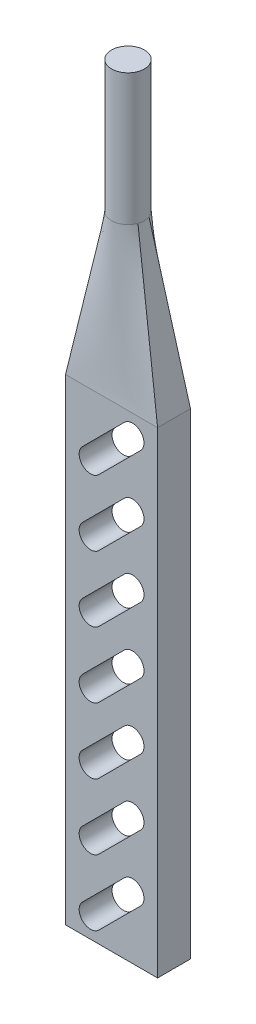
ISO-10303-21;
HEADER;
FILE_DESCRIPTION(('STEP AP214'),'2;1');
FILE_NAME('part.step','',(''),(''),'','','');
FILE_SCHEMA(('AUTOMOTIVE_DESIGN { 1 0 10303 214 1 1 1 1 }'));
ENDSEC;
DATA;
#1=APPLICATION_CONTEXT('core data for automotive mechanical design processes');
#2=APPLICATION_PROTOCOL_DEFINITION('international standard','automotive_design',2000,#1);
#3=PRODUCT_CONTEXT('',#1,'mechanical');
#4=PRODUCT('Part','Part','',(#3));
#5=PRODUCT_RELATED_PRODUCT_CATEGORY('part','',(#4));
#6=PRODUCT_DEFINITION_FORMATION('','',#4);
#7=PRODUCT_DEFINITION_CONTEXT('part definition',#1,'design');
#8=PRODUCT_DEFINITION('design','',#6,#7);
#9=PRODUCT_DEFINITION_SHAPE('','',#8);
#10=(LENGTH_UNIT() NAMED_UNIT(*) SI_UNIT(.MILLI.,.METRE.));
#11=(NAMED_UNIT(*) PLANE_ANGLE_UNIT() SI_UNIT($,.RADIAN.));
#12=(NAMED_UNIT(*) SI_UNIT($,.STERADIAN.) SOLID_ANGLE_UNIT());
#13=UNCERTAINTY_MEASURE_WITH_UNIT(LENGTH_MEASURE(1.E-05),#10,'distance_accuracy_value','');
#14=(GEOMETRIC_REPRESENTATION_CONTEXT(3) GLOBAL_UNCERTAINTY_ASSIGNED_CONTEXT((#13)) GLOBAL_UNIT_ASSIGNED_CONTEXT((#10,
#11,#12)) REPRESENTATION_CONTEXT('',''));
#15=CARTESIAN_POINT('',(0.,0.,0.));
#16=DIRECTION('',(0.,0.,1.));
#17=DIRECTION('',(1.,0.,0.));
#18=AXIS2_PLACEMENT_3D('',#15,#16,#17);
#19=CARTESIAN_POINT('',(-8.83883476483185,-63.889087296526,5.));
#20=DIRECTION('',(0.707106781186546,-0.707106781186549,0.));
#21=DIRECTION('',(0.707106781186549,0.707106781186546,0.));
#22=AXIS2_PLACEMENT_3D('',#19,#20,#21);
#23=PLANE('',#22);
#24=DIRECTION('',(0.,0.,-1.));
#25=VECTOR('',#24,1.);
#26=CARTESIAN_POINT('',(3.88908729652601,-51.1611652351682,5.));
#27=LINE('',#26,#25);
#28=CARTESIAN_POINT('',(3.88908729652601,-51.1611652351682,5.));
#29=VERTEX_POINT('',#28);
#30=CARTESIAN_POINT('',(3.88908729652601,-51.1611652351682,-5.));
#31=VERTEX_POINT('',#30);
#32=EDGE_CURVE('E12',#29,#31,#27,.T.);
#33=ORIENTED_EDGE('',*,*,#32,.F.);
#34=DIRECTION('',(-0.707106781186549,-0.707106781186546,0.));
#35=VECTOR('',#34,1.);
#36=CARTESIAN_POINT('',(-8.83883476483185,-63.889087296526,5.));
#37=LINE('',#36,#35);
#38=CARTESIAN_POINT('',(-8.83883476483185,-63.889087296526,5.));
#39=VERTEX_POINT('',#38);
#40=EDGE_CURVE('E601',#29,#39,#37,.T.);
#41=ORIENTED_EDGE('',*,*,#40,.T.);
#42=DIRECTION('',(0.,0.,-1.));
#43=VECTOR('',#42,1.);
#44=CARTESIAN_POINT('',(-8.83883476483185,-63.889087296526,5.));
#45=LINE('',#44,#43);
#46=CARTESIAN_POINT('',(-8.83883476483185,-63.889087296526,-5.));
#47=VERTEX_POINT('',#46);
#48=EDGE_CURVE('E269',#39,#47,#45,.T.);
#49=ORIENTED_EDGE('',*,*,#48,.T.);
#50=DIRECTION('',(-0.707106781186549,-0.707106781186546,0.));
#51=VECTOR('',#50,1.);
#52=CARTESIAN_POINT('',(-8.83883476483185,-63.889087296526,-5.));
#53=LINE('',#52,#51);
#54=EDGE_CURVE('E265',#31,#47,#53,.T.);
#55=ORIENTED_EDGE('',*,*,#54,.F.);
#56=EDGE_LOOP('',(#33,#41,#49,#55));
#57=FACE_BOUND('',#56,.T.);
#58=ADVANCED_FACE('F70',(#57),#23,.T.);
#59=CARTESIAN_POINT('',(6.36396103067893,-53.6360389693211,5.));
#60=DIRECTION('',(0.,0.,-1.));
#61=DIRECTION('',(-1.,0.,0.));
#62=AXIS2_PLACEMENT_3D('',#59,#60,#61);
#63=CYLINDRICAL_SURFACE('',#62,3.5);
#64=DIRECTION('',(0.,0.,-1.));
#65=VECTOR('',#64,1.);
#66=CARTESIAN_POINT('',(8.83883476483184,-56.110912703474,5.));
#67=LINE('',#66,#65);
#68=CARTESIAN_POINT('',(8.83883476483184,-56.110912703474,5.));
#69=VERTEX_POINT('',#68);
#70=CARTESIAN_POINT('',(8.83883476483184,-56.110912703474,-5.));
#71=VERTEX_POINT('',#70);
#72=EDGE_CURVE('E80',#69,#71,#67,.T.);
#73=ORIENTED_EDGE('',*,*,#72,.F.);
#74=CARTESIAN_POINT('',(6.36396103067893,-53.6360389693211,5.));
#75=DIRECTION('',(0.,0.,1.));
#76=DIRECTION('',(1.,0.,0.));
#77=AXIS2_PLACEMENT_3D('',#74,#75,#76);
#78=CIRCLE('',#77,3.5);
#79=EDGE_CURVE('E603',#69,#29,#78,.T.);
#80=ORIENTED_EDGE('',*,*,#79,.T.);
#81=ORIENTED_EDGE('',*,*,#32,.T.);
#82=CARTESIAN_POINT('',(6.36396103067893,-53.6360389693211,-5.));
#83=DIRECTION('',(0.,0.,1.));
#84=DIRECTION('',(1.,0.,0.));
#85=AXIS2_PLACEMENT_3D('',#82,#83,#84);
#86=CIRCLE('',#85,3.5);
#87=EDGE_CURVE('E253',#71,#31,#86,.T.);
#88=ORIENTED_EDGE('',*,*,#87,.F.);
#89=EDGE_LOOP('',(#73,#80,#81,#88));
#90=FACE_BOUND('',#89,.T.);
#91=ADVANCED_FACE('F259',(#90),#63,.F.);
#92=CARTESIAN_POINT('',(-3.88908729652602,-68.8388347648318,5.));
#93=DIRECTION('',(-0.707106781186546,0.707106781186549,0.));
#94=DIRECTION('',(-0.707106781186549,-0.707106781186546,0.));
#95=AXIS2_PLACEMENT_3D('',#92,#93,#94);
#96=PLANE('',#95);
#97=DIRECTION('',(0.,0.,-1.));
#98=VECTOR('',#97,1.);
#99=CARTESIAN_POINT('',(-3.88908729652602,-68.8388347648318,5.));
#100=LINE('',#99,#98);
#101=CARTESIAN_POINT('',(-3.88908729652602,-68.8388347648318,5.));
#102=VERTEX_POINT('',#101);
#103=CARTESIAN_POINT('',(-3.88908729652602,-68.8388347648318,-5.));
#104=VERTEX_POINT('',#103);
#105=EDGE_CURVE('E268',#102,#104,#100,.T.);
#106=ORIENTED_EDGE('',*,*,#105,.F.);
#107=DIRECTION('',(0.707106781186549,0.707106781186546,0.));
#108=VECTOR('',#107,1.);
#109=CARTESIAN_POINT('',(-3.88908729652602,-68.8388347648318,5.));
#110=LINE('',#109,#108);
#111=EDGE_CURVE('E270',#102,#69,#110,.T.);
#112=ORIENTED_EDGE('',*,*,#111,.T.);
#113=ORIENTED_EDGE('',*,*,#72,.T.);
#114=DIRECTION('',(0.707106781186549,0.707106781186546,0.));
#115=VECTOR('',#114,1.);
#116=CARTESIAN_POINT('',(-3.88908729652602,-68.8388347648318,-5.));
#117=LINE('',#116,#115);
#118=EDGE_CURVE('E248',#104,#71,#117,.T.);
#119=ORIENTED_EDGE('',*,*,#118,.F.);
#120=EDGE_LOOP('',(#106,#112,#113,#119));
#121=FACE_BOUND('',#120,.T.);
#122=ADVANCED_FACE('F264',(#121),#96,.T.);
#123=CARTESIAN_POINT('',(-6.36396103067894,-66.3639610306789,5.));
#124=DIRECTION('',(0.,0.,-1.));
#125=DIRECTION('',(-1.,0.,0.));
#126=AXIS2_PLACEMENT_3D('',#123,#124,#125);
#127=CYLINDRICAL_SURFACE('',#126,3.5);
#128=ORIENTED_EDGE('',*,*,#48,.F.);
#129=CARTESIAN_POINT('',(-6.36396103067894,-66.3639610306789,5.));
#130=DIRECTION('',(0.,0.,1.));
#131=DIRECTION('',(1.,0.,0.));
#132=AXIS2_PLACEMENT_3D('',#129,#130,#131);
#133=CIRCLE('',#132,3.5);
#134=EDGE_CURVE('E597',#39,#102,#133,.T.);
#135=ORIENTED_EDGE('',*,*,#134,.T.);
#136=ORIENTED_EDGE('',*,*,#105,.T.);
#137=CARTESIAN_POINT('',(-6.36396103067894,-66.3639610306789,-5.));
#138=DIRECTION('',(0.,0.,1.));
#139=DIRECTION('',(1.,0.,0.));
#140=AXIS2_PLACEMENT_3D('',#137,#138,#139);
#141=CIRCLE('',#140,3.5);
#142=EDGE_CURVE('E88',#47,#104,#141,.T.);
#143=ORIENTED_EDGE('',*,*,#142,.F.);
#144=EDGE_LOOP('',(#128,#135,#136,#143));
#145=FACE_BOUND('',#144,.T.);
#146=ADVANCED_FACE('F608',(#145),#127,.F.);
#147=CARTESIAN_POINT('',(-8.83883476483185,-43.889087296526,5.));
#148=DIRECTION('',(0.707106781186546,-0.707106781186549,0.));
#149=DIRECTION('',(0.707106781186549,0.707106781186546,0.));
#150=AXIS2_PLACEMENT_3D('',#147,#148,#149);
#151=PLANE('',#150);
#152=DIRECTION('',(0.,0.,-1.));
#153=VECTOR('',#152,1.);
#154=CARTESIAN_POINT('',(3.88908729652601,-31.1611652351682,5.));
#155=LINE('',#154,#153);
#156=CARTESIAN_POINT('',(3.88908729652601,-31.1611652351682,5.));
#157=VERTEX_POINT('',#156);
#158=CARTESIAN_POINT('',(3.88908729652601,-31.1611652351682,-5.));
#159=VERTEX_POINT('',#158);
#160=EDGE_CURVE('E596',#157,#159,#155,.T.);
#161=ORIENTED_EDGE('',*,*,#160,.F.);
#162=DIRECTION('',(-0.707106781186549,-0.707106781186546,0.));
#163=VECTOR('',#162,1.);
#164=CARTESIAN_POINT('',(-8.83883476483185,-43.889087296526,5.));
#165=LINE('',#164,#163);
#166=CARTESIAN_POINT('',(-8.83883476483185,-43.889087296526,5.));
#167=VERTEX_POINT('',#166);
#168=EDGE_CURVE('E569',#157,#167,#165,.T.);
#169=ORIENTED_EDGE('',*,*,#168,.T.);
#170=DIRECTION('',(0.,0.,-1.));
#171=VECTOR('',#170,1.);
#172=CARTESIAN_POINT('',(-8.83883476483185,-43.889087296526,5.));
#173=LINE('',#172,#171);
#174=CARTESIAN_POINT('',(-8.83883476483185,-43.889087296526,-5.));
#175=VERTEX_POINT('',#174);
#176=EDGE_CURVE('E590',#167,#175,#173,.T.);
#177=ORIENTED_EDGE('',*,*,#176,.T.);
#178=DIRECTION('',(-0.707106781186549,-0.707106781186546,0.));
#179=VECTOR('',#178,1.);
#180=CARTESIAN_POINT('',(-8.83883476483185,-43.889087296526,-5.));
#181=LINE('',#180,#179);
#182=EDGE_CURVE('E585',#159,#175,#181,.T.);
#183=ORIENTED_EDGE('',*,*,#182,.F.);
#184=EDGE_LOOP('',(#161,#169,#177,#183));
#185=FACE_BOUND('',#184,.T.);
#186=ADVANCED_FACE('F639',(#185),#151,.T.);
#187=CARTESIAN_POINT('',(6.36396103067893,-33.6360389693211,5.));
#188=DIRECTION('',(0.,0.,-1.));
#189=DIRECTION('',(-1.,0.,0.));
#190=AXIS2_PLACEMENT_3D('',#187,#188,#189);
#191=CYLINDRICAL_SURFACE('',#190,3.5);
#192=DIRECTION('',(0.,0.,-1.));
#193=VECTOR('',#192,1.);
#194=CARTESIAN_POINT('',(8.83883476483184,-36.110912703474,5.));
#195=LINE('',#194,#193);
#196=CARTESIAN_POINT('',(8.83883476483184,-36.110912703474,5.));
#197=VERTEX_POINT('',#196);
#198=CARTESIAN_POINT('',(8.83883476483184,-36.110912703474,-5.));
#199=VERTEX_POINT('',#198);
#200=EDGE_CURVE('E593',#197,#199,#195,.T.);
#201=ORIENTED_EDGE('',*,*,#200,.F.);
#202=CARTESIAN_POINT('',(6.36396103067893,-33.6360389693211,5.));
#203=DIRECTION('',(0.,0.,1.));
#204=DIRECTION('',(1.,0.,0.));
#205=AXIS2_PLACEMENT_3D('',#202,#203,#204);
#206=CIRCLE('',#205,3.5);
#207=EDGE_CURVE('E575',#197,#157,#206,.T.);
#208=ORIENTED_EDGE('',*,*,#207,.T.);
#209=ORIENTED_EDGE('',*,*,#160,.T.);
#210=CARTESIAN_POINT('',(6.36396103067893,-33.6360389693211,-5.));
#211=DIRECTION('',(0.,0.,1.));
#212=DIRECTION('',(1.,0.,0.));
#213=AXIS2_PLACEMENT_3D('',#210,#211,#212);
#214=CIRCLE('',#213,3.5);
#215=EDGE_CURVE('E582',#199,#159,#214,.T.);
#216=ORIENTED_EDGE('',*,*,#215,.F.);
#217=EDGE_LOOP('',(#201,#208,#209,#216));
#218=FACE_BOUND('',#217,.T.);
#219=ADVANCED_FACE('F641',(#218),#191,.F.);
#220=CARTESIAN_POINT('',(-3.88908729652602,-48.8388347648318,5.));
#221=DIRECTION('',(-0.707106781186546,0.707106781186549,0.));
#222=DIRECTION('',(-0.707106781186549,-0.707106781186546,0.));
#223=AXIS2_PLACEMENT_3D('',#220,#221,#222);
#224=PLANE('',#223);
#225=DIRECTION('',(0.,0.,-1.));
#226=VECTOR('',#225,1.);
#227=CARTESIAN_POINT('',(-3.88908729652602,-48.8388347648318,5.));
#228=LINE('',#227,#226);
#229=CARTESIAN_POINT('',(-3.88908729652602,-48.8388347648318,5.));
#230=VERTEX_POINT('',#229);
#231=CARTESIAN_POINT('',(-3.88908729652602,-48.8388347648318,-5.));
#232=VERTEX_POINT('',#231);
#233=EDGE_CURVE('E587',#230,#232,#228,.T.);
#234=ORIENTED_EDGE('',*,*,#233,.F.);
#235=DIRECTION('',(0.707106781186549,0.707106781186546,0.));
#236=VECTOR('',#235,1.);
#237=CARTESIAN_POINT('',(-3.88908729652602,-48.8388347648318,5.));
#238=LINE('',#237,#236);
#239=EDGE_CURVE('E572',#230,#197,#238,.T.);
#240=ORIENTED_EDGE('',*,*,#239,.T.);
#241=ORIENTED_EDGE('',*,*,#200,.T.);
#242=DIRECTION('',(0.707106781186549,0.707106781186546,0.));
#243=VECTOR('',#242,1.);
#244=CARTESIAN_POINT('',(-3.88908729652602,-48.8388347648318,-5.));
#245=LINE('',#244,#243);
#246=EDGE_CURVE('E579',#232,#199,#245,.T.);
#247=ORIENTED_EDGE('',*,*,#246,.F.);
#248=EDGE_LOOP('',(#234,#240,#241,#247));
#249=FACE_BOUND('',#248,.T.);
#250=ADVANCED_FACE('F650',(#249),#224,.T.);
#251=CARTESIAN_POINT('',(-6.36396103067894,-46.3639610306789,5.));
#252=DIRECTION('',(0.,0.,-1.));
#253=DIRECTION('',(-1.,0.,0.));
#254=AXIS2_PLACEMENT_3D('',#251,#252,#253);
#255=CYLINDRICAL_SURFACE('',#254,3.5);
#256=ORIENTED_EDGE('',*,*,#176,.F.);
#257=CARTESIAN_POINT('',(-6.36396103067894,-46.3639610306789,5.));
#258=DIRECTION('',(0.,0.,1.));
#259=DIRECTION('',(1.,0.,0.));
#260=AXIS2_PLACEMENT_3D('',#257,#258,#259);
#261=CIRCLE('',#260,3.5);
#262=EDGE_CURVE('E570',#167,#230,#261,.T.);
#263=ORIENTED_EDGE('',*,*,#262,.T.);
#264=ORIENTED_EDGE('',*,*,#233,.T.);
#265=CARTESIAN_POINT('',(-6.36396103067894,-46.3639610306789,-5.));
#266=DIRECTION('',(0.,0.,1.));
#267=DIRECTION('',(1.,0.,0.));
#268=AXIS2_PLACEMENT_3D('',#265,#266,#267);
#269=CIRCLE('',#268,3.5);
#270=EDGE_CURVE('E578',#175,#232,#269,.T.);
#271=ORIENTED_EDGE('',*,*,#270,.F.);
#272=EDGE_LOOP('',(#256,#263,#264,#271));
#273=FACE_BOUND('',#272,.T.);
#274=ADVANCED_FACE('F651',(#273),#255,.F.);
#275=CARTESIAN_POINT('',(-8.83883476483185,-23.889087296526,5.));
#276=DIRECTION('',(0.707106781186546,-0.707106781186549,0.));
#277=DIRECTION('',(0.707106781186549,0.707106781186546,0.));
#278=AXIS2_PLACEMENT_3D('',#275,#276,#277);
#279=PLANE('',#278);
#280=DIRECTION('',(0.,0.,-1.));
#281=VECTOR('',#280,1.);
#282=CARTESIAN_POINT('',(3.88908729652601,-11.1611652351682,5.));
#283=LINE('',#282,#281);
#284=CARTESIAN_POINT('',(3.88908729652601,-11.1611652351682,5.));
#285=VERTEX_POINT('',#284);
#286=CARTESIAN_POINT('',(3.88908729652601,-11.1611652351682,-5.));
#287=VERTEX_POINT('',#286);
#288=EDGE_CURVE('E562',#285,#287,#283,.T.);
#289=ORIENTED_EDGE('',*,*,#288,.F.);
#290=DIRECTION('',(-0.707106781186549,-0.707106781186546,0.));
#291=VECTOR('',#290,1.);
#292=CARTESIAN_POINT('',(-8.83883476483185,-23.889087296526,5.));
#293=LINE('',#292,#291);
#294=CARTESIAN_POINT('',(-8.83883476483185,-23.889087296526,5.));
#295=VERTEX_POINT('',#294);
#296=EDGE_CURVE('E540',#285,#295,#293,.T.);
#297=ORIENTED_EDGE('',*,*,#296,.T.);
#298=DIRECTION('',(0.,0.,-1.));
#299=VECTOR('',#298,1.);
#300=CARTESIAN_POINT('',(-8.83883476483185,-23.889087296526,5.));
#301=LINE('',#300,#299);
#302=CARTESIAN_POINT('',(-8.83883476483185,-23.889087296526,-5.));
#303=VERTEX_POINT('',#302);
#304=EDGE_CURVE('E553',#295,#303,#301,.T.);
#305=ORIENTED_EDGE('',*,*,#304,.T.);
#306=DIRECTION('',(-0.707106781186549,-0.707106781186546,0.));
#307=VECTOR('',#306,1.);
#308=CARTESIAN_POINT('',(-8.83883476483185,-23.889087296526,-5.));
#309=LINE('',#308,#307);
#310=EDGE_CURVE('E555',#287,#303,#309,.T.);
#311=ORIENTED_EDGE('',*,*,#310,.F.);
#312=EDGE_LOOP('',(#289,#297,#305,#311));
#313=FACE_BOUND('',#312,.T.);
#314=ADVANCED_FACE('F654',(#313),#279,.T.);
#315=CARTESIAN_POINT('',(6.36396103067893,-13.6360389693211,5.));
#316=DIRECTION('',(0.,0.,-1.));
#317=DIRECTION('',(-1.,0.,0.));
#318=AXIS2_PLACEMENT_3D('',#315,#316,#317);
#319=CYLINDRICAL_SURFACE('',#318,3.5);
#320=DIRECTION('',(0.,0.,-1.));
#321=VECTOR('',#320,1.);
#322=CARTESIAN_POINT('',(8.83883476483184,-16.110912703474,5.));
#323=LINE('',#322,#321);
#324=CARTESIAN_POINT('',(8.83883476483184,-16.110912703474,5.));
#325=VERTEX_POINT('',#324);
#326=CARTESIAN_POINT('',(8.83883476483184,-16.110912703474,-5.));
#327=VERTEX_POINT('',#326);
#328=EDGE_CURVE('E561',#325,#327,#323,.T.);
#329=ORIENTED_EDGE('',*,*,#328,.F.);
#330=CARTESIAN_POINT('',(6.36396103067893,-13.6360389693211,5.));
#331=DIRECTION('',(0.,0.,1.));
#332=DIRECTION('',(1.,0.,0.));
#333=AXIS2_PLACEMENT_3D('',#330,#331,#332);
#334=CIRCLE('',#333,3.5);
#335=EDGE_CURVE('E539',#325,#285,#334,.T.);
#336=ORIENTED_EDGE('',*,*,#335,.T.);
#337=ORIENTED_EDGE('',*,*,#288,.T.);
#338=CARTESIAN_POINT('',(6.36396103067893,-13.6360389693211,-5.));
#339=DIRECTION('',(0.,0.,1.));
#340=DIRECTION('',(1.,0.,0.));
#341=AXIS2_PLACEMENT_3D('',#338,#339,#340);
#342=CIRCLE('',#341,3.5);
#343=EDGE_CURVE('E549',#327,#287,#342,.T.);
#344=ORIENTED_EDGE('',*,*,#343,.F.);
#345=EDGE_LOOP('',(#329,#336,#337,#344));
#346=FACE_BOUND('',#345,.T.);
#347=ADVANCED_FACE('F658',(#346),#319,.F.);
#348=CARTESIAN_POINT('',(-3.88908729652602,-28.8388347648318,5.));
#349=DIRECTION('',(-0.707106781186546,0.707106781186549,0.));
#350=DIRECTION('',(-0.707106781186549,-0.707106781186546,0.));
#351=AXIS2_PLACEMENT_3D('',#348,#349,#350);
#352=PLANE('',#351);
#353=DIRECTION('',(0.,0.,-1.));
#354=VECTOR('',#353,1.);
#355=CARTESIAN_POINT('',(-3.88908729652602,-28.8388347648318,5.));
#356=LINE('',#355,#354);
#357=CARTESIAN_POINT('',(-3.88908729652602,-28.8388347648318,5.));
#358=VERTEX_POINT('',#357);
#359=CARTESIAN_POINT('',(-3.88908729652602,-28.8388347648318,-5.));
#360=VERTEX_POINT('',#359);
#361=EDGE_CURVE('E556',#358,#360,#356,.T.);
#362=ORIENTED_EDGE('',*,*,#361,.F.);
#363=DIRECTION('',(0.707106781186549,0.707106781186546,0.));
#364=VECTOR('',#363,1.);
#365=CARTESIAN_POINT('',(-3.88908729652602,-28.8388347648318,5.));
#366=LINE('',#365,#364);
#367=EDGE_CURVE('E543',#358,#325,#366,.T.);
#368=ORIENTED_EDGE('',*,*,#367,.T.);
#369=ORIENTED_EDGE('',*,*,#328,.T.);
#370=DIRECTION('',(0.707106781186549,0.707106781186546,0.));
#371=VECTOR('',#370,1.);
#372=CARTESIAN_POINT('',(-3.88908729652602,-28.8388347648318,-5.));
#373=LINE('',#372,#371);
#374=EDGE_CURVE('E547',#360,#327,#373,.T.);
#375=ORIENTED_EDGE('',*,*,#374,.F.);
#376=EDGE_LOOP('',(#362,#368,#369,#375));
#377=FACE_BOUND('',#376,.T.);
#378=ADVANCED_FACE('F664',(#377),#352,.T.);
#379=CARTESIAN_POINT('',(-6.36396103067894,-26.3639610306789,5.));
#380=DIRECTION('',(0.,0.,-1.));
#381=DIRECTION('',(-1.,0.,0.));
#382=AXIS2_PLACEMENT_3D('',#379,#380,#381);
#383=CYLINDRICAL_SURFACE('',#382,3.5);
#384=ORIENTED_EDGE('',*,*,#304,.F.);
#385=CARTESIAN_POINT('',(-6.36396103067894,-26.3639610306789,5.));
#386=DIRECTION('',(0.,0.,1.));
#387=DIRECTION('',(1.,0.,0.));
#388=AXIS2_PLACEMENT_3D('',#385,#386,#387);
#389=CIRCLE('',#388,3.5);
#390=EDGE_CURVE('E532',#295,#358,#389,.T.);
#391=ORIENTED_EDGE('',*,*,#390,.T.);
#392=ORIENTED_EDGE('',*,*,#361,.T.);
#393=CARTESIAN_POINT('',(-6.36396103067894,-26.3639610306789,-5.));
#394=DIRECTION('',(0.,0.,1.));
#395=DIRECTION('',(1.,0.,0.));
#396=AXIS2_PLACEMENT_3D('',#393,#394,#395);
#397=CIRCLE('',#396,3.5);
#398=EDGE_CURVE('E546',#303,#360,#397,.T.);
#399=ORIENTED_EDGE('',*,*,#398,.F.);
#400=EDGE_LOOP('',(#384,#391,#392,#399));
#401=FACE_BOUND('',#400,.T.);
#402=ADVANCED_FACE('F670',(#401),#383,.F.);
#403=CARTESIAN_POINT('',(-8.83883476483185,56.110912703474,5.));
#404=DIRECTION('',(0.707106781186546,-0.707106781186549,0.));
#405=DIRECTION('',(0.707106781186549,0.707106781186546,0.));
#406=AXIS2_PLACEMENT_3D('',#403,#404,#405);
#407=PLANE('',#406);
#408=DIRECTION('',(0.,0.,-1.));
#409=VECTOR('',#408,1.);
#410=CARTESIAN_POINT('',(3.88908729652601,68.8388347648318,5.));
#411=LINE('',#410,#409);
#412=CARTESIAN_POINT('',(3.88908729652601,68.8388347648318,5.));
#413=VERTEX_POINT('',#412);
#414=CARTESIAN_POINT('',(3.88908729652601,68.8388347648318,-5.));
#415=VERTEX_POINT('',#414);
#416=EDGE_CURVE('E535',#413,#415,#411,.T.);
#417=ORIENTED_EDGE('',*,*,#416,.F.);
#418=DIRECTION('',(-0.707106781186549,-0.707106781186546,0.));
#419=VECTOR('',#418,1.);
#420=CARTESIAN_POINT('',(-8.83883476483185,56.110912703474,5.));
#421=LINE('',#420,#419);
#422=CARTESIAN_POINT('',(-8.83883476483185,56.110912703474,5.));
#423=VERTEX_POINT('',#422);
#424=EDGE_CURVE('E502',#413,#423,#421,.T.);
#425=ORIENTED_EDGE('',*,*,#424,.T.);
#426=DIRECTION('',(0.,0.,-1.));
#427=VECTOR('',#426,1.);
#428=CARTESIAN_POINT('',(-8.83883476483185,56.110912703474,5.));
#429=LINE('',#428,#427);
#430=CARTESIAN_POINT('',(-8.83883476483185,56.110912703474,-5.));
#431=VERTEX_POINT('',#430);
#432=EDGE_CURVE('E523',#423,#431,#429,.T.);
#433=ORIENTED_EDGE('',*,*,#432,.T.);
#434=DIRECTION('',(-0.707106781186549,-0.707106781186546,0.));
#435=VECTOR('',#434,1.);
#436=CARTESIAN_POINT('',(-8.83883476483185,56.110912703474,-5.));
#437=LINE('',#436,#435);
#438=EDGE_CURVE('E517',#415,#431,#437,.T.);
#439=ORIENTED_EDGE('',*,*,#438,.F.);
#440=EDGE_LOOP('',(#417,#425,#433,#439));
#441=FACE_BOUND('',#440,.T.);
#442=ADVANCED_FACE('F671',(#441),#407,.T.);
#443=CARTESIAN_POINT('',(6.36396103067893,66.3639610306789,5.));
#444=DIRECTION('',(0.,0.,-1.));
#445=DIRECTION('',(-1.,0.,0.));
#446=AXIS2_PLACEMENT_3D('',#443,#444,#445);
#447=CYLINDRICAL_SURFACE('',#446,3.5);
#448=DIRECTION('',(0.,0.,-1.));
#449=VECTOR('',#448,1.);
#450=CARTESIAN_POINT('',(8.83883476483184,63.889087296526,5.));
#451=LINE('',#450,#449);
#452=CARTESIAN_POINT('',(8.83883476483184,63.889087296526,5.));
#453=VERTEX_POINT('',#452);
#454=CARTESIAN_POINT('',(8.83883476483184,63.889087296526,-5.));
#455=VERTEX_POINT('',#454);
#456=EDGE_CURVE('E530',#453,#455,#451,.T.);
#457=ORIENTED_EDGE('',*,*,#456,.F.);
#458=CARTESIAN_POINT('',(6.36396103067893,66.3639610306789,5.));
#459=DIRECTION('',(0.,0.,1.));
#460=DIRECTION('',(1.,0.,0.));
#461=AXIS2_PLACEMENT_3D('',#458,#459,#460);
#462=CIRCLE('',#461,3.5);
#463=EDGE_CURVE('E508',#453,#413,#462,.T.);
#464=ORIENTED_EDGE('',*,*,#463,.T.);
#465=ORIENTED_EDGE('',*,*,#416,.T.);
#466=CARTESIAN_POINT('',(6.36396103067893,66.3639610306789,-5.));
#467=DIRECTION('',(0.,0.,1.));
#468=DIRECTION('',(1.,0.,0.));
#469=AXIS2_PLACEMENT_3D('',#466,#467,#468);
#470=CIRCLE('',#469,3.5);
#471=EDGE_CURVE('E516',#455,#415,#470,.T.);
#472=ORIENTED_EDGE('',*,*,#471,.F.);
#473=EDGE_LOOP('',(#457,#464,#465,#472));
#474=FACE_BOUND('',#473,.T.);
#475=ADVANCED_FACE('F674',(#474),#447,.F.);
#476=CARTESIAN_POINT('',(-3.88908729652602,51.1611652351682,5.));
#477=DIRECTION('',(-0.707106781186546,0.707106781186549,0.));
#478=DIRECTION('',(-0.707106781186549,-0.707106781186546,0.));
#479=AXIS2_PLACEMENT_3D('',#476,#477,#478);
#480=PLANE('',#479);
#481=DIRECTION('',(0.,0.,-1.));
#482=VECTOR('',#481,1.);
#483=CARTESIAN_POINT('',(-3.88908729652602,51.1611652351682,5.));
#484=LINE('',#483,#482);
#485=CARTESIAN_POINT('',(-3.88908729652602,51.1611652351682,5.));
#486=VERTEX_POINT('',#485);
#487=CARTESIAN_POINT('',(-3.88908729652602,51.1611652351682,-5.));
#488=VERTEX_POINT('',#487);
#489=EDGE_CURVE('E528',#486,#488,#484,.T.);
#490=ORIENTED_EDGE('',*,*,#489,.F.);
#491=DIRECTION('',(0.707106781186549,0.707106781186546,0.));
#492=VECTOR('',#491,1.);
#493=CARTESIAN_POINT('',(-3.88908729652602,51.1611652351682,5.));
#494=LINE('',#493,#492);
#495=EDGE_CURVE('E512',#486,#453,#494,.T.);
#496=ORIENTED_EDGE('',*,*,#495,.T.);
#497=ORIENTED_EDGE('',*,*,#456,.T.);
#498=DIRECTION('',(0.707106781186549,0.707106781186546,0.));
#499=VECTOR('',#498,1.);
#500=CARTESIAN_POINT('',(-3.88908729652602,51.1611652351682,-5.));
#501=LINE('',#500,#499);
#502=EDGE_CURVE('E518',#488,#455,#501,.T.);
#503=ORIENTED_EDGE('',*,*,#502,.F.);
#504=EDGE_LOOP('',(#490,#496,#497,#503));
#505=FACE_BOUND('',#504,.T.);
#506=ADVANCED_FACE('F679',(#505),#480,.T.);
#507=CARTESIAN_POINT('',(-6.36396103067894,53.6360389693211,5.));
#508=DIRECTION('',(0.,0.,-1.));
#509=DIRECTION('',(-1.,0.,0.));
#510=AXIS2_PLACEMENT_3D('',#507,#508,#509);
#511=CYLINDRICAL_SURFACE('',#510,3.5);
#512=ORIENTED_EDGE('',*,*,#432,.F.);
#513=CARTESIAN_POINT('',(-6.36396103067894,53.6360389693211,5.));
#514=DIRECTION('',(0.,0.,1.));
#515=DIRECTION('',(1.,0.,0.));
#516=AXIS2_PLACEMENT_3D('',#513,#514,#515);
#517=CIRCLE('',#516,3.5);
#518=EDGE_CURVE('E501',#423,#486,#517,.T.);
#519=ORIENTED_EDGE('',*,*,#518,.T.);
#520=ORIENTED_EDGE('',*,*,#489,.T.);
#521=CARTESIAN_POINT('',(-6.36396103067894,53.6360389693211,-5.));
#522=DIRECTION('',(0.,0.,1.));
#523=DIRECTION('',(1.,0.,0.));
#524=AXIS2_PLACEMENT_3D('',#521,#522,#523);
#525=CIRCLE('',#524,3.5);
#526=EDGE_CURVE('E514',#431,#488,#525,.T.);
#527=ORIENTED_EDGE('',*,*,#526,.F.);
#528=EDGE_LOOP('',(#512,#519,#520,#527));
#529=FACE_BOUND('',#528,.T.);
#530=ADVANCED_FACE('F681',(#529),#511,.F.);
#531=CARTESIAN_POINT('',(-8.83883476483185,36.110912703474,5.));
#532=DIRECTION('',(0.707106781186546,-0.707106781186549,0.));
#533=DIRECTION('',(0.707106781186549,0.707106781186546,0.));
#534=AXIS2_PLACEMENT_3D('',#531,#532,#533);
#535=PLANE('',#534);
#536=DIRECTION('',(0.,0.,-1.));
#537=VECTOR('',#536,1.);
#538=CARTESIAN_POINT('',(3.88908729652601,48.8388347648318,5.));
#539=LINE('',#538,#537);
#540=CARTESIAN_POINT('',(3.88908729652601,48.8388347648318,5.));
#541=VERTEX_POINT('',#540);
#542=CARTESIAN_POINT('',(3.88908729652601,48.8388347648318,-5.));
#543=VERTEX_POINT('',#542);
#544=EDGE_CURVE('E498',#541,#543,#539,.T.);
#545=ORIENTED_EDGE('',*,*,#544,.F.);
#546=DIRECTION('',(-0.707106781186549,-0.707106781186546,0.));
#547=VECTOR('',#546,1.);
#548=CARTESIAN_POINT('',(-8.83883476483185,36.110912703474,5.));
#549=LINE('',#548,#547);
#550=CARTESIAN_POINT('',(-8.83883476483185,36.110912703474,5.));
#551=VERTEX_POINT('',#550);
#552=EDGE_CURVE('E471',#541,#551,#549,.T.);
#553=ORIENTED_EDGE('',*,*,#552,.T.);
#554=DIRECTION('',(0.,0.,-1.));
#555=VECTOR('',#554,1.);
#556=CARTESIAN_POINT('',(-8.83883476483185,36.110912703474,5.));
#557=LINE('',#556,#555);
#558=CARTESIAN_POINT('',(-8.83883476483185,36.110912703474,-5.));
#559=VERTEX_POINT('',#558);
#560=EDGE_CURVE('E491',#551,#559,#557,.T.);
#561=ORIENTED_EDGE('',*,*,#560,.T.);
#562=DIRECTION('',(-0.707106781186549,-0.707106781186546,0.));
#563=VECTOR('',#562,1.);
#564=CARTESIAN_POINT('',(-8.83883476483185,36.110912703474,-5.));
#565=LINE('',#564,#563);
#566=EDGE_CURVE('E488',#543,#559,#565,.T.);
#567=ORIENTED_EDGE('',*,*,#566,.F.);
#568=EDGE_LOOP('',(#545,#553,#561,#567));
#569=FACE_BOUND('',#568,.T.);
#570=ADVANCED_FACE('F690',(#569),#535,.T.);
#571=CARTESIAN_POINT('',(6.36396103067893,46.3639610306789,5.));
#572=DIRECTION('',(0.,0.,-1.));
#573=DIRECTION('',(-1.,0.,0.));
#574=AXIS2_PLACEMENT_3D('',#571,#572,#573);
#575=CYLINDRICAL_SURFACE('',#574,3.5);
#576=DIRECTION('',(0.,0.,-1.));
#577=VECTOR('',#576,1.);
#578=CARTESIAN_POINT('',(8.83883476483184,43.889087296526,5.));
#579=LINE('',#578,#577);
#580=CARTESIAN_POINT('',(8.83883476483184,43.889087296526,5.));
#581=VERTEX_POINT('',#580);
#582=CARTESIAN_POINT('',(8.83883476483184,43.889087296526,-5.));
#583=VERTEX_POINT('',#582);
#584=EDGE_CURVE('E500',#581,#583,#579,.T.);
#585=ORIENTED_EDGE('',*,*,#584,.F.);
#586=CARTESIAN_POINT('',(6.36396103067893,46.3639610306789,5.));
#587=DIRECTION('',(0.,0.,1.));
#588=DIRECTION('',(1.,0.,0.));
#589=AXIS2_PLACEMENT_3D('',#586,#587,#588);
#590=CIRCLE('',#589,3.5);
#591=EDGE_CURVE('E478',#581,#541,#590,.T.);
#592=ORIENTED_EDGE('',*,*,#591,.T.);
#593=ORIENTED_EDGE('',*,*,#544,.T.);
#594=CARTESIAN_POINT('',(6.36396103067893,46.3639610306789,-5.));
#595=DIRECTION('',(0.,0.,1.));
#596=DIRECTION('',(1.,0.,0.));
#597=AXIS2_PLACEMENT_3D('',#594,#595,#596);
#598=CIRCLE('',#597,3.5);
#599=EDGE_CURVE('E486',#583,#543,#598,.T.);
#600=ORIENTED_EDGE('',*,*,#599,.F.);
#601=EDGE_LOOP('',(#585,#592,#593,#600));
#602=FACE_BOUND('',#601,.T.);
#603=ADVANCED_FACE('F693',(#602),#575,.F.);
#604=CARTESIAN_POINT('',(-3.88908729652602,31.1611652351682,5.));
#605=DIRECTION('',(-0.707106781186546,0.707106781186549,0.));
#606=DIRECTION('',(-0.707106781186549,-0.707106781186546,0.));
#607=AXIS2_PLACEMENT_3D('',#604,#605,#606);
#608=PLANE('',#607);
#609=DIRECTION('',(0.,0.,-1.));
#610=VECTOR('',#609,1.);
#611=CARTESIAN_POINT('',(-3.88908729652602,31.1611652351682,5.));
#612=LINE('',#611,#610);
#613=CARTESIAN_POINT('',(-3.88908729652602,31.1611652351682,5.));
#614=VERTEX_POINT('',#613);
#615=CARTESIAN_POINT('',(-3.88908729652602,31.1611652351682,-5.));
#616=VERTEX_POINT('',#615);
#617=EDGE_CURVE('E493',#614,#616,#612,.T.);
#618=ORIENTED_EDGE('',*,*,#617,.F.);
#619=DIRECTION('',(0.707106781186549,0.707106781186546,0.));
#620=VECTOR('',#619,1.);
#621=CARTESIAN_POINT('',(-3.88908729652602,31.1611652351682,5.));
#622=LINE('',#621,#620);
#623=EDGE_CURVE('E479',#614,#581,#622,.T.);
#624=ORIENTED_EDGE('',*,*,#623,.T.);
#625=ORIENTED_EDGE('',*,*,#584,.T.);
#626=DIRECTION('',(0.707106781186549,0.707106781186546,0.));
#627=VECTOR('',#626,1.);
#628=CARTESIAN_POINT('',(-3.88908729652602,31.1611652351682,-5.));
#629=LINE('',#628,#627);
#630=EDGE_CURVE('E482',#616,#583,#629,.T.);
#631=ORIENTED_EDGE('',*,*,#630,.F.);
#632=EDGE_LOOP('',(#618,#624,#625,#631));
#633=FACE_BOUND('',#632,.T.);
#634=ADVANCED_FACE('F621',(#633),#608,.T.);
#635=CARTESIAN_POINT('',(-6.36396103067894,33.6360389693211,5.));
#636=DIRECTION('',(0.,0.,-1.));
#637=DIRECTION('',(-1.,0.,0.));
#638=AXIS2_PLACEMENT_3D('',#635,#636,#637);
#639=CYLINDRICAL_SURFACE('',#638,3.5);
#640=ORIENTED_EDGE('',*,*,#560,.F.);
#641=CARTESIAN_POINT('',(-6.36396103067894,33.6360389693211,5.));
#642=DIRECTION('',(0.,0.,1.));
#643=DIRECTION('',(1.,0.,0.));
#644=AXIS2_PLACEMENT_3D('',#641,#642,#643);
#645=CIRCLE('',#644,3.5);
#646=EDGE_CURVE('E289',#551,#614,#645,.T.);
#647=ORIENTED_EDGE('',*,*,#646,.T.);
#648=ORIENTED_EDGE('',*,*,#617,.T.);
#649=CARTESIAN_POINT('',(-6.36396103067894,33.6360389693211,-5.));
#650=DIRECTION('',(0.,0.,1.));
#651=DIRECTION('',(1.,0.,0.));
#652=AXIS2_PLACEMENT_3D('',#649,#650,#651);
#653=CIRCLE('',#652,3.5);
#654=EDGE_CURVE('E485',#559,#616,#653,.T.);
#655=ORIENTED_EDGE('',*,*,#654,.F.);
#656=EDGE_LOOP('',(#640,#647,#648,#655));
#657=FACE_BOUND('',#656,.T.);
#658=ADVANCED_FACE('F614',(#657),#639,.F.);
#659=CARTESIAN_POINT('',(0.,0.,5.));
#660=DIRECTION('',(0.,0.,-1.));
#661=DIRECTION('',(-1.,0.,0.));
#662=AXIS2_PLACEMENT_3D('',#659,#660,#661);
#663=PLANE('',#662);
#664=CARTESIAN_POINT('',(-6.36396103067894,-6.36396103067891,5.));
#665=DIRECTION('',(0.,0.,1.));
#666=DIRECTION('',(1.,0.,0.));
#667=AXIS2_PLACEMENT_3D('',#664,#665,#666);
#668=CIRCLE('',#667,3.5);
#669=CARTESIAN_POINT('',(-8.83883476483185,-3.88908729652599,5.));
#670=VERTEX_POINT('',#669);
#671=CARTESIAN_POINT('',(-3.88908729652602,-8.83883476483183,5.));
#672=VERTEX_POINT('',#671);
#673=EDGE_CURVE('E795',#670,#672,#668,.T.);
#674=ORIENTED_EDGE('',*,*,#673,.F.);
#675=DIRECTION('',(-0.707106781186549,-0.707106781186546,0.));
#676=VECTOR('',#675,1.);
#677=CARTESIAN_POINT('',(-8.83883476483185,-3.88908729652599,5.));
#678=LINE('',#677,#676);
#679=CARTESIAN_POINT('',(3.88908729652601,8.83883476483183,5.));
#680=VERTEX_POINT('',#679);
#681=EDGE_CURVE('E803',#680,#670,#678,.T.);
#682=ORIENTED_EDGE('',*,*,#681,.F.);
#683=CARTESIAN_POINT('',(6.36396103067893,6.36396103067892,5.));
#684=DIRECTION('',(0.,0.,1.));
#685=DIRECTION('',(1.,0.,0.));
#686=AXIS2_PLACEMENT_3D('',#683,#684,#685);
#687=CIRCLE('',#686,3.5);
#688=CARTESIAN_POINT('',(8.83883476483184,3.88908729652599,5.));
#689=VERTEX_POINT('',#688);
#690=EDGE_CURVE('E798',#689,#680,#687,.T.);
#691=ORIENTED_EDGE('',*,*,#690,.F.);
#692=DIRECTION('',(0.707106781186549,0.707106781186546,0.));
#693=VECTOR('',#692,1.);
#694=CARTESIAN_POINT('',(-3.88908729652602,-8.83883476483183,5.));
#695=LINE('',#694,#693);
#696=EDGE_CURVE('E792',#672,#689,#695,.T.);
#697=ORIENTED_EDGE('',*,*,#696,.F.);
#698=EDGE_LOOP('',(#674,#682,#691,#697));
#699=FACE_BOUND('',#698,.T.);
#700=DIRECTION('',(0.,1.,0.));
#701=VECTOR('',#700,1.);
#702=CARTESIAN_POINT('',(14.,-72.5,5.));
#703=LINE('',#702,#701);
#704=CARTESIAN_POINT('',(14.,-72.5,5.));
#705=VERTEX_POINT('',#704);
#706=CARTESIAN_POINT('',(14.0000000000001,72.4999999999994,5.00000000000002));
#707=VERTEX_POINT('',#706);
#708=EDGE_CURVE('E279',#705,#707,#703,.T.);
#709=ORIENTED_EDGE('',*,*,#708,.T.);
#710=DIRECTION('',(-1.,0.,0.));
#711=VECTOR('',#710,1.);
#712=CARTESIAN_POINT('',(0.,72.5,5.));
#713=LINE('',#712,#711);
#714=CARTESIAN_POINT('',(-14.0000000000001,72.4999999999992,5.00000000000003));
#715=VERTEX_POINT('',#714);
#716=EDGE_CURVE('E110',#707,#715,#713,.T.);
#717=ORIENTED_EDGE('',*,*,#716,.T.);
#718=DIRECTION('',(0.,-1.,0.));
#719=VECTOR('',#718,1.);
#720=CARTESIAN_POINT('',(-14.,-72.5,5.));
#721=LINE('',#720,#719);
#722=CARTESIAN_POINT('',(-14.,-72.5,5.));
#723=VERTEX_POINT('',#722);
#724=EDGE_CURVE('E115',#715,#723,#721,.T.);
#725=ORIENTED_EDGE('',*,*,#724,.T.);
#726=DIRECTION('',(1.,0.,0.));
#727=VECTOR('',#726,1.);
#728=CARTESIAN_POINT('',(-14.,-72.5,5.));
#729=LINE('',#728,#727);
#730=EDGE_CURVE('E285',#723,#705,#729,.T.);
#731=ORIENTED_EDGE('',*,*,#730,.T.);
#732=EDGE_LOOP('',(#709,#717,#725,#731));
#733=FACE_BOUND('',#732,.T.);
#734=CARTESIAN_POINT('',(-6.36396103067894,13.6360389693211,5.));
#735=DIRECTION('',(0.,0.,1.));
#736=DIRECTION('',(1.,0.,0.));
#737=AXIS2_PLACEMENT_3D('',#734,#735,#736);
#738=CIRCLE('',#737,3.5);
#739=CARTESIAN_POINT('',(-8.83883476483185,16.110912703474,5.));
#740=VERTEX_POINT('',#739);
#741=CARTESIAN_POINT('',(-3.88908729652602,11.1611652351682,5.));
#742=VERTEX_POINT('',#741);
#743=EDGE_CURVE('E773',#740,#742,#738,.T.);
#744=ORIENTED_EDGE('',*,*,#743,.F.);
#745=DIRECTION('',(-0.707106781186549,-0.707106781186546,0.));
#746=VECTOR('',#745,1.);
#747=CARTESIAN_POINT('',(-8.83883476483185,16.110912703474,5.));
#748=LINE('',#747,#746);
#749=CARTESIAN_POINT('',(3.88908729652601,28.8388347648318,5.));
#750=VERTEX_POINT('',#749);
#751=EDGE_CURVE('E306',#750,#740,#748,.T.);
#752=ORIENTED_EDGE('',*,*,#751,.F.);
#753=CARTESIAN_POINT('',(6.36396103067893,26.3639610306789,5.));
#754=DIRECTION('',(0.,0.,1.));
#755=DIRECTION('',(1.,0.,0.));
#756=AXIS2_PLACEMENT_3D('',#753,#754,#755);
#757=CIRCLE('',#756,3.5);
#758=CARTESIAN_POINT('',(8.83883476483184,23.889087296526,5.));
#759=VERTEX_POINT('',#758);
#760=EDGE_CURVE('E744',#759,#750,#757,.T.);
#761=ORIENTED_EDGE('',*,*,#760,.F.);
#762=DIRECTION('',(0.707106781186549,0.707106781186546,0.));
#763=VECTOR('',#762,1.);
#764=CARTESIAN_POINT('',(-3.88908729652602,11.1611652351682,5.));
#765=LINE('',#764,#763);
#766=EDGE_CURVE('E758',#742,#759,#765,.T.);
#767=ORIENTED_EDGE('',*,*,#766,.F.);
#768=EDGE_LOOP('',(#744,#752,#761,#767));
#769=FACE_BOUND('',#768,.T.);
#770=ORIENTED_EDGE('',*,*,#646,.F.);
#771=ORIENTED_EDGE('',*,*,#552,.F.);
#772=ORIENTED_EDGE('',*,*,#591,.F.);
#773=ORIENTED_EDGE('',*,*,#623,.F.);
#774=EDGE_LOOP('',(#770,#771,#772,#773));
#775=FACE_BOUND('',#774,.T.);
#776=ORIENTED_EDGE('',*,*,#518,.F.);
#777=ORIENTED_EDGE('',*,*,#424,.F.);
#778=ORIENTED_EDGE('',*,*,#463,.F.);
#779=ORIENTED_EDGE('',*,*,#495,.F.);
#780=EDGE_LOOP('',(#776,#777,#778,#779));
#781=FACE_BOUND('',#780,.T.);
#782=ORIENTED_EDGE('',*,*,#390,.F.);
#783=ORIENTED_EDGE('',*,*,#296,.F.);
#784=ORIENTED_EDGE('',*,*,#335,.F.);
#785=ORIENTED_EDGE('',*,*,#367,.F.);
#786=EDGE_LOOP('',(#782,#783,#784,#785));
#787=FACE_BOUND('',#786,.T.);
#788=ORIENTED_EDGE('',*,*,#262,.F.);
#789=ORIENTED_EDGE('',*,*,#168,.F.);
#790=ORIENTED_EDGE('',*,*,#207,.F.);
#791=ORIENTED_EDGE('',*,*,#239,.F.);
#792=EDGE_LOOP('',(#788,#789,#790,#791));
#793=FACE_BOUND('',#792,.T.);
#794=ORIENTED_EDGE('',*,*,#134,.F.);
#795=ORIENTED_EDGE('',*,*,#40,.F.);
#796=ORIENTED_EDGE('',*,*,#79,.F.);
#797=ORIENTED_EDGE('',*,*,#111,.F.);
#798=EDGE_LOOP('',(#794,#795,#796,#797));
#799=FACE_BOUND('',#798,.T.);
#800=ADVANCED_FACE('F615',(#699,#733,#769,#775,#781,#787,#793,#799),#663,.F.);
#801=CARTESIAN_POINT('',(0.,0.,-5.));
#802=DIRECTION('',(0.,0.,-1.));
#803=DIRECTION('',(-1.,0.,0.));
#804=AXIS2_PLACEMENT_3D('',#801,#802,#803);
#805=PLANE('',#804);
#806=DIRECTION('',(0.,1.,0.));
#807=VECTOR('',#806,1.);
#808=CARTESIAN_POINT('',(14.,-72.5,-5.));
#809=LINE('',#808,#807);
#810=CARTESIAN_POINT('',(14.,-72.5,-5.));
#811=VERTEX_POINT('',#810);
#812=CARTESIAN_POINT('',(14.0000000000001,72.4999999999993,-5.00000000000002));
#813=VERTEX_POINT('',#812);
#814=EDGE_CURVE('E273',#811,#813,#809,.T.);
#815=ORIENTED_EDGE('',*,*,#814,.F.);
#816=DIRECTION('',(1.,0.,0.));
#817=VECTOR('',#816,1.);
#818=CARTESIAN_POINT('',(-14.,-72.5,-5.));
#819=LINE('',#818,#817);
#820=CARTESIAN_POINT('',(-14.,-72.5,-5.));
#821=VERTEX_POINT('',#820);
#822=EDGE_CURVE('E278',#821,#811,#819,.T.);
#823=ORIENTED_EDGE('',*,*,#822,.F.);
#824=DIRECTION('',(0.,-1.,0.));
#825=VECTOR('',#824,1.);
#826=CARTESIAN_POINT('',(-14.,-72.5,-5.));
#827=LINE('',#826,#825);
#828=CARTESIAN_POINT('',(-14.0000000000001,72.4999999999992,-5.00000000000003));
#829=VERTEX_POINT('',#828);
#830=EDGE_CURVE('E281',#829,#821,#827,.T.);
#831=ORIENTED_EDGE('',*,*,#830,.F.);
#832=DIRECTION('',(-1.,0.,0.));
#833=VECTOR('',#832,1.);
#834=CARTESIAN_POINT('',(0.,72.5,-5.));
#835=LINE('',#834,#833);
#836=EDGE_CURVE('E277',#813,#829,#835,.T.);
#837=ORIENTED_EDGE('',*,*,#836,.F.);
#838=EDGE_LOOP('',(#815,#823,#831,#837));
#839=FACE_BOUND('',#838,.T.);
#840=DIRECTION('',(-0.707106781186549,-0.707106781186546,0.));
#841=VECTOR('',#840,1.);
#842=CARTESIAN_POINT('',(-8.83883476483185,-3.88908729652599,-5.));
#843=LINE('',#842,#841);
#844=CARTESIAN_POINT('',(3.88908729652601,8.83883476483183,-5.));
#845=VERTEX_POINT('',#844);
#846=CARTESIAN_POINT('',(-8.83883476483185,-3.88908729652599,-5.));
#847=VERTEX_POINT('',#846);
#848=EDGE_CURVE('E789',#845,#847,#843,.T.);
#849=ORIENTED_EDGE('',*,*,#848,.T.);
#850=CARTESIAN_POINT('',(-6.36396103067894,-6.36396103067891,-5.));
#851=DIRECTION('',(0.,0.,1.));
#852=DIRECTION('',(1.,0.,0.));
#853=AXIS2_PLACEMENT_3D('',#850,#851,#852);
#854=CIRCLE('',#853,3.5);
#855=CARTESIAN_POINT('',(-3.88908729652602,-8.83883476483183,-5.));
#856=VERTEX_POINT('',#855);
#857=EDGE_CURVE('E777',#847,#856,#854,.T.);
#858=ORIENTED_EDGE('',*,*,#857,.T.);
#859=DIRECTION('',(0.707106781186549,0.707106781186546,0.));
#860=VECTOR('',#859,1.);
#861=CARTESIAN_POINT('',(-3.88908729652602,-8.83883476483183,-5.));
#862=LINE('',#861,#860);
#863=CARTESIAN_POINT('',(8.83883476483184,3.88908729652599,-5.));
#864=VERTEX_POINT('',#863);
#865=EDGE_CURVE('E783',#856,#864,#862,.T.);
#866=ORIENTED_EDGE('',*,*,#865,.T.);
#867=CARTESIAN_POINT('',(6.36396103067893,6.36396103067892,-5.));
#868=DIRECTION('',(0.,0.,1.));
#869=DIRECTION('',(1.,0.,0.));
#870=AXIS2_PLACEMENT_3D('',#867,#868,#869);
#871=CIRCLE('',#870,3.5);
#872=EDGE_CURVE('E787',#864,#845,#871,.T.);
#873=ORIENTED_EDGE('',*,*,#872,.T.);
#874=EDGE_LOOP('',(#849,#858,#866,#873));
#875=FACE_BOUND('',#874,.T.);
#876=DIRECTION('',(-0.707106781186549,-0.707106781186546,0.));
#877=VECTOR('',#876,1.);
#878=CARTESIAN_POINT('',(-8.83883476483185,16.110912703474,-5.));
#879=LINE('',#878,#877);
#880=CARTESIAN_POINT('',(3.88908729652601,28.8388347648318,-5.));
#881=VERTEX_POINT('',#880);
#882=CARTESIAN_POINT('',(-8.83883476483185,16.110912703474,-5.));
#883=VERTEX_POINT('',#882);
#884=EDGE_CURVE('E321',#881,#883,#879,.T.);
#885=ORIENTED_EDGE('',*,*,#884,.T.);
#886=CARTESIAN_POINT('',(-6.36396103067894,13.6360389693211,-5.));
#887=DIRECTION('',(0.,0.,1.));
#888=DIRECTION('',(1.,0.,0.));
#889=AXIS2_PLACEMENT_3D('',#886,#887,#888);
#890=CIRCLE('',#889,3.5);
#891=CARTESIAN_POINT('',(-3.88908729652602,11.1611652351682,-5.));
#892=VERTEX_POINT('',#891);
#893=EDGE_CURVE('E780',#883,#892,#890,.T.);
#894=ORIENTED_EDGE('',*,*,#893,.T.);
#895=DIRECTION('',(0.707106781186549,0.707106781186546,0.));
#896=VECTOR('',#895,1.);
#897=CARTESIAN_POINT('',(-3.88908729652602,11.1611652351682,-5.));
#898=LINE('',#897,#896);
#899=CARTESIAN_POINT('',(8.83883476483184,23.889087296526,-5.));
#900=VERTEX_POINT('',#899);
#901=EDGE_CURVE('E764',#892,#900,#898,.T.);
#902=ORIENTED_EDGE('',*,*,#901,.T.);
#903=CARTESIAN_POINT('',(6.36396103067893,26.3639610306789,-5.));
#904=DIRECTION('',(0.,0.,1.));
#905=DIRECTION('',(1.,0.,0.));
#906=AXIS2_PLACEMENT_3D('',#903,#904,#905);
#907=CIRCLE('',#906,3.5);
#908=EDGE_CURVE('E750',#900,#881,#907,.T.);
#909=ORIENTED_EDGE('',*,*,#908,.T.);
#910=EDGE_LOOP('',(#885,#894,#902,#909));
#911=FACE_BOUND('',#910,.T.);
#912=ORIENTED_EDGE('',*,*,#654,.T.);
#913=ORIENTED_EDGE('',*,*,#630,.T.);
#914=ORIENTED_EDGE('',*,*,#599,.T.);
#915=ORIENTED_EDGE('',*,*,#566,.T.);
#916=EDGE_LOOP('',(#912,#913,#914,#915));
#917=FACE_BOUND('',#916,.T.);
#918=ORIENTED_EDGE('',*,*,#526,.T.);
#919=ORIENTED_EDGE('',*,*,#502,.T.);
#920=ORIENTED_EDGE('',*,*,#471,.T.);
#921=ORIENTED_EDGE('',*,*,#438,.T.);
#922=EDGE_LOOP('',(#918,#919,#920,#921));
#923=FACE_BOUND('',#922,.T.);
#924=ORIENTED_EDGE('',*,*,#398,.T.);
#925=ORIENTED_EDGE('',*,*,#374,.T.);
#926=ORIENTED_EDGE('',*,*,#343,.T.);
#927=ORIENTED_EDGE('',*,*,#310,.T.);
#928=EDGE_LOOP('',(#924,#925,#926,#927));
#929=FACE_BOUND('',#928,.T.);
#930=ORIENTED_EDGE('',*,*,#270,.T.);
#931=ORIENTED_EDGE('',*,*,#246,.T.);
#932=ORIENTED_EDGE('',*,*,#215,.T.);
#933=ORIENTED_EDGE('',*,*,#182,.T.);
#934=EDGE_LOOP('',(#930,#931,#932,#933));
#935=FACE_BOUND('',#934,.T.);
#936=ORIENTED_EDGE('',*,*,#142,.T.);
#937=ORIENTED_EDGE('',*,*,#118,.T.);
#938=ORIENTED_EDGE('',*,*,#87,.T.);
#939=ORIENTED_EDGE('',*,*,#54,.T.);
#940=EDGE_LOOP('',(#936,#937,#938,#939));
#941=FACE_BOUND('',#940,.T.);
#942=ADVANCED_FACE('F249',(#839,#875,#911,#917,#923,#929,#935,#941),#805,.T.);
#943=CARTESIAN_POINT('',(14.,-72.5,5.));
#944=DIRECTION('',(-1.,0.,0.));
#945=DIRECTION('',(0.,0.,1.));
#946=AXIS2_PLACEMENT_3D('',#943,#944,#945);
#947=PLANE('',#946);
#948=ORIENTED_EDGE('',*,*,#814,.T.);
#949=DIRECTION('',(0.,0.,1.));
#950=VECTOR('',#949,1.);
#951=CARTESIAN_POINT('',(14.,72.5,5.));
#952=LINE('',#951,#950);
#953=EDGE_CURVE('E290',#707,#813,#952,.F.);
#954=ORIENTED_EDGE('',*,*,#953,.F.);
#955=ORIENTED_EDGE('',*,*,#708,.F.);
#956=DIRECTION('',(0.,0.,-1.));
#957=VECTOR('',#956,1.);
#958=CARTESIAN_POINT('',(14.,-72.5,5.));
#959=LINE('',#958,#957);
#960=EDGE_CURVE('E453',#705,#811,#959,.T.);
#961=ORIENTED_EDGE('',*,*,#960,.T.);
#962=EDGE_LOOP('',(#948,#954,#955,#961));
#963=FACE_BOUND('',#962,.T.);
#964=ADVANCED_FACE('F446',(#963),#947,.F.);
#965=CARTESIAN_POINT('',(-14.,-72.5,5.));
#966=DIRECTION('',(1.,0.,0.));
#967=DIRECTION('',(0.,0.,-1.));
#968=AXIS2_PLACEMENT_3D('',#965,#966,#967);
#969=PLANE('',#968);
#970=ORIENTED_EDGE('',*,*,#830,.T.);
#971=DIRECTION('',(0.,0.,-1.));
#972=VECTOR('',#971,1.);
#973=CARTESIAN_POINT('',(-14.,-72.5,5.));
#974=LINE('',#973,#972);
#975=EDGE_CURVE('E293',#723,#821,#974,.T.);
#976=ORIENTED_EDGE('',*,*,#975,.F.);
#977=ORIENTED_EDGE('',*,*,#724,.F.);
#978=DIRECTION('',(0.,0.,-1.));
#979=VECTOR('',#978,1.);
#980=CARTESIAN_POINT('',(-14.,72.5,5.));
#981=LINE('',#980,#979);
#982=EDGE_CURVE('E292',#715,#829,#981,.T.);
#983=ORIENTED_EDGE('',*,*,#982,.T.);
#984=EDGE_LOOP('',(#970,#976,#977,#983));
#985=FACE_BOUND('',#984,.T.);
#986=ADVANCED_FACE('F458',(#985),#969,.F.);
#987=CARTESIAN_POINT('',(-14.,-72.5,5.));
#988=DIRECTION('',(0.,1.,0.));
#989=DIRECTION('',(0.,0.,1.));
#990=AXIS2_PLACEMENT_3D('',#987,#988,#989);
#991=PLANE('',#990);
#992=ORIENTED_EDGE('',*,*,#822,.T.);
#993=ORIENTED_EDGE('',*,*,#960,.F.);
#994=ORIENTED_EDGE('',*,*,#730,.F.);
#995=ORIENTED_EDGE('',*,*,#975,.T.);
#996=EDGE_LOOP('',(#992,#993,#994,#995));
#997=FACE_BOUND('',#996,.T.);
#998=ADVANCED_FACE('F462',(#997),#991,.F.);
#999=CARTESIAN_POINT('',(-6.36396103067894,-6.36396103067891,5.));
#1000=DIRECTION('',(0.,0.,-1.));
#1001=DIRECTION('',(-1.,0.,0.));
#1002=AXIS2_PLACEMENT_3D('',#999,#1000,#1001);
#1003=CYLINDRICAL_SURFACE('',#1002,3.5);
#1004=DIRECTION('',(0.,0.,-1.));
#1005=VECTOR('',#1004,1.);
#1006=CARTESIAN_POINT('',(-8.83883476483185,-3.88908729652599,5.));
#1007=LINE('',#1006,#1005);
#1008=EDGE_CURVE('E805',#670,#847,#1007,.T.);
#1009=ORIENTED_EDGE('',*,*,#1008,.F.);
#1010=ORIENTED_EDGE('',*,*,#673,.T.);
#1011=DIRECTION('',(0.,0.,-1.));
#1012=VECTOR('',#1011,1.);
#1013=CARTESIAN_POINT('',(-3.88908729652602,-8.83883476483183,5.));
#1014=LINE('',#1013,#1012);
#1015=EDGE_CURVE('E280',#672,#856,#1014,.T.);
#1016=ORIENTED_EDGE('',*,*,#1015,.T.);
#1017=ORIENTED_EDGE('',*,*,#857,.F.);
#1018=EDGE_LOOP('',(#1009,#1010,#1016,#1017));
#1019=FACE_BOUND('',#1018,.T.);
#1020=ADVANCED_FACE('F702',(#1019),#1003,.F.);
#1021=CARTESIAN_POINT('',(-3.88908729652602,-8.83883476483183,5.));
#1022=DIRECTION('',(-0.707106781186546,0.707106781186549,0.));
#1023=DIRECTION('',(-0.707106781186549,-0.707106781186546,0.));
#1024=AXIS2_PLACEMENT_3D('',#1021,#1022,#1023);
#1025=PLANE('',#1024);
#1026=ORIENTED_EDGE('',*,*,#1015,.F.);
#1027=ORIENTED_EDGE('',*,*,#696,.T.);
#1028=DIRECTION('',(0.,0.,-1.));
#1029=VECTOR('',#1028,1.);
#1030=CARTESIAN_POINT('',(8.83883476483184,3.88908729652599,5.));
#1031=LINE('',#1030,#1029);
#1032=EDGE_CURVE('E809',#689,#864,#1031,.T.);
#1033=ORIENTED_EDGE('',*,*,#1032,.T.);
#1034=ORIENTED_EDGE('',*,*,#865,.F.);
#1035=EDGE_LOOP('',(#1026,#1027,#1033,#1034));
#1036=FACE_BOUND('',#1035,.T.);
#1037=ADVANCED_FACE('F708',(#1036),#1025,.T.);
#1038=CARTESIAN_POINT('',(6.36396103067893,6.36396103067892,5.));
#1039=DIRECTION('',(0.,0.,-1.));
#1040=DIRECTION('',(-1.,0.,0.));
#1041=AXIS2_PLACEMENT_3D('',#1038,#1039,#1040);
#1042=CYLINDRICAL_SURFACE('',#1041,3.5);
#1043=ORIENTED_EDGE('',*,*,#1032,.F.);
#1044=ORIENTED_EDGE('',*,*,#690,.T.);
#1045=DIRECTION('',(0.,0.,-1.));
#1046=VECTOR('',#1045,1.);
#1047=CARTESIAN_POINT('',(3.88908729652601,8.83883476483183,5.));
#1048=LINE('',#1047,#1046);
#1049=EDGE_CURVE('E810',#680,#845,#1048,.T.);
#1050=ORIENTED_EDGE('',*,*,#1049,.T.);
#1051=ORIENTED_EDGE('',*,*,#872,.F.);
#1052=EDGE_LOOP('',(#1043,#1044,#1050,#1051));
#1053=FACE_BOUND('',#1052,.T.);
#1054=ADVANCED_FACE('F712',(#1053),#1042,.F.);
#1055=CARTESIAN_POINT('',(-8.83883476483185,-3.88908729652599,5.));
#1056=DIRECTION('',(0.707106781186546,-0.707106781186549,0.));
#1057=DIRECTION('',(0.707106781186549,0.707106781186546,0.));
#1058=AXIS2_PLACEMENT_3D('',#1055,#1056,#1057);
#1059=PLANE('',#1058);
#1060=ORIENTED_EDGE('',*,*,#1049,.F.);
#1061=ORIENTED_EDGE('',*,*,#681,.T.);
#1062=ORIENTED_EDGE('',*,*,#1008,.T.);
#1063=ORIENTED_EDGE('',*,*,#848,.F.);
#1064=EDGE_LOOP('',(#1060,#1061,#1062,#1063));
#1065=FACE_BOUND('',#1064,.T.);
#1066=ADVANCED_FACE('F718',(#1065),#1059,.T.);
#1067=CARTESIAN_POINT('',(-6.36396103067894,13.6360389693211,5.));
#1068=DIRECTION('',(0.,0.,-1.));
#1069=DIRECTION('',(-1.,0.,0.));
#1070=AXIS2_PLACEMENT_3D('',#1067,#1068,#1069);
#1071=CYLINDRICAL_SURFACE('',#1070,3.5);
#1072=DIRECTION('',(0.,0.,-1.));
#1073=VECTOR('',#1072,1.);
#1074=CARTESIAN_POINT('',(-8.83883476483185,16.110912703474,5.));
#1075=LINE('',#1074,#1073);
#1076=EDGE_CURVE('E754',#740,#883,#1075,.T.);
#1077=ORIENTED_EDGE('',*,*,#1076,.F.);
#1078=ORIENTED_EDGE('',*,*,#743,.T.);
#1079=DIRECTION('',(0.,0.,-1.));
#1080=VECTOR('',#1079,1.);
#1081=CARTESIAN_POINT('',(-3.88908729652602,11.1611652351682,5.));
#1082=LINE('',#1081,#1080);
#1083=EDGE_CURVE('E761',#742,#892,#1082,.T.);
#1084=ORIENTED_EDGE('',*,*,#1083,.T.);
#1085=ORIENTED_EDGE('',*,*,#893,.F.);
#1086=EDGE_LOOP('',(#1077,#1078,#1084,#1085));
#1087=FACE_BOUND('',#1086,.T.);
#1088=ADVANCED_FACE('F721',(#1087),#1071,.F.);
#1089=CARTESIAN_POINT('',(-3.88908729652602,11.1611652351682,5.));
#1090=DIRECTION('',(-0.707106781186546,0.707106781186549,0.));
#1091=DIRECTION('',(-0.707106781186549,-0.707106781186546,0.));
#1092=AXIS2_PLACEMENT_3D('',#1089,#1090,#1091);
#1093=PLANE('',#1092);
#1094=ORIENTED_EDGE('',*,*,#1083,.F.);
#1095=ORIENTED_EDGE('',*,*,#766,.T.);
#1096=DIRECTION('',(0.,0.,-1.));
#1097=VECTOR('',#1096,1.);
#1098=CARTESIAN_POINT('',(8.83883476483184,23.889087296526,5.));
#1099=LINE('',#1098,#1097);
#1100=EDGE_CURVE('E741',#759,#900,#1099,.T.);
#1101=ORIENTED_EDGE('',*,*,#1100,.T.);
#1102=ORIENTED_EDGE('',*,*,#901,.F.);
#1103=EDGE_LOOP('',(#1094,#1095,#1101,#1102));
#1104=FACE_BOUND('',#1103,.T.);
#1105=ADVANCED_FACE('F730',(#1104),#1093,.T.);
#1106=CARTESIAN_POINT('',(6.36396103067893,26.3639610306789,5.));
#1107=DIRECTION('',(0.,0.,-1.));
#1108=DIRECTION('',(-1.,0.,0.));
#1109=AXIS2_PLACEMENT_3D('',#1106,#1107,#1108);
#1110=CYLINDRICAL_SURFACE('',#1109,3.5);
#1111=ORIENTED_EDGE('',*,*,#1100,.F.);
#1112=ORIENTED_EDGE('',*,*,#760,.T.);
#1113=DIRECTION('',(0.,0.,-1.));
#1114=VECTOR('',#1113,1.);
#1115=CARTESIAN_POINT('',(3.88908729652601,28.8388347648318,5.));
#1116=LINE('',#1115,#1114);
#1117=EDGE_CURVE('E841',#750,#881,#1116,.T.);
#1118=ORIENTED_EDGE('',*,*,#1117,.T.);
#1119=ORIENTED_EDGE('',*,*,#908,.F.);
#1120=EDGE_LOOP('',(#1111,#1112,#1118,#1119));
#1121=FACE_BOUND('',#1120,.T.);
#1122=ADVANCED_FACE('F729',(#1121),#1110,.F.);
#1123=CARTESIAN_POINT('',(-8.83883476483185,16.110912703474,5.));
#1124=DIRECTION('',(0.707106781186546,-0.707106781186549,0.));
#1125=DIRECTION('',(0.707106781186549,0.707106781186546,0.));
#1126=AXIS2_PLACEMENT_3D('',#1123,#1124,#1125);
#1127=PLANE('',#1126);
#1128=ORIENTED_EDGE('',*,*,#1117,.F.);
#1129=ORIENTED_EDGE('',*,*,#751,.T.);
#1130=ORIENTED_EDGE('',*,*,#1076,.T.);
#1131=ORIENTED_EDGE('',*,*,#884,.F.);
#1132=EDGE_LOOP('',(#1128,#1129,#1130,#1131));
#1133=FACE_BOUND('',#1132,.T.);
#1134=ADVANCED_FACE('F362',(#1133),#1127,.T.);
#1135=CARTESIAN_POINT('',(-14.,72.5,5.));
#1136=CARTESIAN_POINT('',(-4.70870955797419,120.,1.68168198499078));
#1137=CARTESIAN_POINT('',(-12.8333333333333,72.5,5.));
#1138=CARTESIAN_POINT('',(-4.5767336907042,120.,2.05121441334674));
#1139=CARTESIAN_POINT('',(-11.6666666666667,72.5,5.));
#1140=CARTESIAN_POINT('',(-4.38986783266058,120.,2.43716473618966));
#1141=CARTESIAN_POINT('',(-9.33333333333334,72.5,5.));
#1142=CARTESIAN_POINT('',(-3.87273096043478,120.,3.19572627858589));
#1143=CARTESIAN_POINT('',(-8.16666666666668,72.5,5.));
#1144=CARTESIAN_POINT('',(-3.54144488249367,120.,3.56806329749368));
#1145=CARTESIAN_POINT('',(-5.83333333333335,72.5,5.));
#1146=CARTESIAN_POINT('',(-2.72742162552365,120.,4.2230414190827));
#1147=CARTESIAN_POINT('',(-4.66666666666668,72.5,5.));
#1148=CARTESIAN_POINT('',(-2.24405101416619,120.,4.50429392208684));
#1149=CARTESIAN_POINT('',(-2.33333333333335,72.5,5.));
#1150=CARTESIAN_POINT('',(-1.17346751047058,120.,4.89360835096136));
#1151=CARTESIAN_POINT('',(-1.16666666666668,72.5,5.));
#1152=CARTESIAN_POINT('',(-0.587265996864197,120.,5.));
#1153=CARTESIAN_POINT('',(1.16666666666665,72.5,5.));
#1154=CARTESIAN_POINT('',(0.587265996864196,120.,5.));
#1155=CARTESIAN_POINT('',(2.33333333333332,72.5,5.));
#1156=CARTESIAN_POINT('',(1.17346751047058,120.,4.89360835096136));
#1157=CARTESIAN_POINT('',(4.66666666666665,72.5,5.));
#1158=CARTESIAN_POINT('',(2.24405101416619,120.,4.50429392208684));
#1159=CARTESIAN_POINT('',(5.83333333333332,72.5,5.));
#1160=CARTESIAN_POINT('',(2.72742162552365,120.,4.2230414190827));
#1161=CARTESIAN_POINT('',(8.16666666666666,72.5,5.));
#1162=CARTESIAN_POINT('',(3.54144488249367,120.,3.56806329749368));
#1163=CARTESIAN_POINT('',(9.33333333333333,72.5,5.));
#1164=CARTESIAN_POINT('',(3.87273096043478,120.,3.19572627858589));
#1165=CARTESIAN_POINT('',(11.6666666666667,72.5,5.));
#1166=CARTESIAN_POINT('',(4.38986783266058,120.,2.43716473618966));
#1167=CARTESIAN_POINT('',(12.8333333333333,72.5,5.));
#1168=CARTESIAN_POINT('',(4.5767336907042,120.,2.05121441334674));
#1169=CARTESIAN_POINT('',(14.,72.5,5.));
#1170=CARTESIAN_POINT('',(4.70870955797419,120.,1.68168198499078));
#1171=B_SPLINE_SURFACE_WITH_KNOTS('',3,1,((#1135,#1136),(#1137,#1138),(#1139,#1140),(#1141,
#1142),(#1143,#1144),(#1145,#1146),(#1147,#1148),(#1149,#1150),(#1151,#1152),(#1153,#1154),
(#1155,#1156),(#1157,#1158),(#1159,#1160),(#1161,#1162),(#1163,#1164),(#1165,#1166),(#1167,
#1168),(#1169,#1170)),.UNSPECIFIED.,.F.,.F.,.F.,(4,2,2,2,2,2,2,2,4),(2,2),(0.,0.125,0.25,0.375,
0.5,0.625,0.75,0.875,1.),(0.,1.),.UNSPECIFIED.);
#1172=DIRECTION('',(-0.191518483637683,0.979102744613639,-0.0683994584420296));
#1173=VECTOR('',#1172,1.);
#1174=CARTESIAN_POINT('',(9.35435477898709,96.25,3.34084099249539));
#1175=LINE('',#1174,#1173);
#1176=CARTESIAN_POINT('',(4.7087831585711,120.,1.68170847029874));
#1177=VERTEX_POINT('',#1176);
#1178=EDGE_CURVE('E432',#707,#1177,#1175,.T.);
#1179=CARTESIAN_POINT('',(0.,120.,0.));
#1180=DIRECTION('',(0.,1.,0.));
#1181=DIRECTION('',(0.,0.,1.));
#1182=AXIS2_PLACEMENT_3D('',#1179,#1180,#1181);
#1183=CIRCLE('',#1182,5.);
#1184=CARTESIAN_POINT('',(-4.70880641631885,120.,1.6817168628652));
#1185=VERTEX_POINT('',#1184);
#1186=EDGE_CURVE('E69',#1185,#1177,#1183,.T.);
#1187=DIRECTION('',(-0.191518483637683,-0.979102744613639,0.0683994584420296));
#1188=VECTOR('',#1187,1.);
#1189=CARTESIAN_POINT('',(-9.3543547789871,96.25,3.34084099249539));
#1190=LINE('',#1189,#1188);
#1191=EDGE_CURVE('E431',#1185,#715,#1190,.T.);
#1192=ORIENTED_EDGE('',*,*,#716,.F.);
#1193=ORIENTED_EDGE('',*,*,#1178,.T.);
#1194=ORIENTED_EDGE('',*,*,#1186,.F.);
#1195=ORIENTED_EDGE('',*,*,#1191,.T.);
#1196=EDGE_LOOP('',(#1192,#1193,#1194,#1195));
#1197=FACE_BOUND('',#1196,.T.);
#1198=ADVANCED_FACE('F356',(#1197),#1171,.T.);
#1199=CARTESIAN_POINT('',(14.,72.5,5.));
#1200=CARTESIAN_POINT('',(4.70870955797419,120.,1.68168198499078));
#1201=CARTESIAN_POINT('',(14.,72.5,3.33333333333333));
#1202=CARTESIAN_POINT('',(4.89724651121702,120.,1.15377851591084));
#1203=CARTESIAN_POINT('',(14.,72.5,1.66666666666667));
#1204=CARTESIAN_POINT('',(5.,120.,0.577379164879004));
#1205=CARTESIAN_POINT('',(14.,72.5,-1.66666666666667));
#1206=CARTESIAN_POINT('',(5.,120.,-0.577379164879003));
#1207=CARTESIAN_POINT('',(14.,72.5,-3.33333333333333));
#1208=CARTESIAN_POINT('',(4.89724651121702,120.,-1.15377851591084));
#1209=CARTESIAN_POINT('',(14.,72.5,-5.));
#1210=CARTESIAN_POINT('',(4.70870955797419,120.,-1.68168198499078));
#1211=B_SPLINE_SURFACE_WITH_KNOTS('',3,1,((#1199,#1200),(#1201,#1202),(#1203,#1204),(#1205,
#1206),(#1207,#1208),(#1209,#1210)),.UNSPECIFIED.,.F.,.F.,.F.,(4,2,4),(2,2),(0.,0.5,1.),(0.,1.),.UNSPECIFIED.);
#1212=DIRECTION('',(-0.191518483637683,0.979102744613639,0.0683994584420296));
#1213=VECTOR('',#1212,1.);
#1214=CARTESIAN_POINT('',(9.35435477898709,96.25,-3.34084099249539));
#1215=LINE('',#1214,#1213);
#1216=CARTESIAN_POINT('',(4.70880641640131,120.,-1.68171686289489));
#1217=VERTEX_POINT('',#1216);
#1218=EDGE_CURVE('E437',#813,#1217,#1215,.T.);
#1219=EDGE_CURVE('E299',#1177,#1217,#1183,.T.);
#1220=ORIENTED_EDGE('',*,*,#953,.T.);
#1221=ORIENTED_EDGE('',*,*,#1218,.T.);
#1222=ORIENTED_EDGE('',*,*,#1219,.F.);
#1223=ORIENTED_EDGE('',*,*,#1178,.F.);
#1224=EDGE_LOOP('',(#1220,#1221,#1222,#1223));
#1225=FACE_BOUND('',#1224,.T.);
#1226=ADVANCED_FACE('F363',(#1225),#1211,.T.);
#1227=CARTESIAN_POINT('',(-14.,72.5,-5.));
#1228=CARTESIAN_POINT('',(-4.70870955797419,120.,-1.68168198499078));
#1229=CARTESIAN_POINT('',(-14.,72.5,-3.33333333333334));
#1230=CARTESIAN_POINT('',(-4.89724651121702,120.,-1.15377851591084));
#1231=CARTESIAN_POINT('',(-14.,72.5,-1.66666666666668));
#1232=CARTESIAN_POINT('',(-5.,120.,-0.577379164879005));
#1233=CARTESIAN_POINT('',(-14.,72.5,1.66666666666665));
#1234=CARTESIAN_POINT('',(-5.,120.,0.577379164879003));
#1235=CARTESIAN_POINT('',(-14.,72.5,3.33333333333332));
#1236=CARTESIAN_POINT('',(-4.89724651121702,120.,1.15377851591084));
#1237=CARTESIAN_POINT('',(-14.,72.5,5.));
#1238=CARTESIAN_POINT('',(-4.70870955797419,120.,1.68168198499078));
#1239=B_SPLINE_SURFACE_WITH_KNOTS('',3,1,((#1227,#1228),(#1229,#1230),(#1231,#1232),(#1233,
#1234),(#1235,#1236),(#1237,#1238)),.UNSPECIFIED.,.F.,.F.,.F.,(4,2,4),(2,2),(0.,0.5,1.),(0.,1.),.UNSPECIFIED.);
#1240=CARTESIAN_POINT('',(-4.70878315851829,120.,-1.68170847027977));
#1241=VERTEX_POINT('',#1240);
#1242=EDGE_CURVE('E311',#1241,#1185,#1183,.T.);
#1243=DIRECTION('',(0.191518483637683,0.979102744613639,0.0683994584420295));
#1244=VECTOR('',#1243,1.);
#1245=CARTESIAN_POINT('',(-9.3543547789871,96.25,-3.34084099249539));
#1246=LINE('',#1245,#1244);
#1247=EDGE_CURVE('E297',#829,#1241,#1246,.T.);
#1248=ORIENTED_EDGE('',*,*,#982,.F.);
#1249=ORIENTED_EDGE('',*,*,#1191,.F.);
#1250=ORIENTED_EDGE('',*,*,#1242,.F.);
#1251=ORIENTED_EDGE('',*,*,#1247,.F.);
#1252=EDGE_LOOP('',(#1248,#1249,#1250,#1251));
#1253=FACE_BOUND('',#1252,.T.);
#1254=ADVANCED_FACE('F393',(#1253),#1239,.T.);
#1255=CARTESIAN_POINT('',(14.,72.5,-5.));
#1256=CARTESIAN_POINT('',(4.70870955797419,120.,-1.68168198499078));
#1257=CARTESIAN_POINT('',(12.8333333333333,72.5,-5.));
#1258=CARTESIAN_POINT('',(4.5767336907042,120.,-2.05121441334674));
#1259=CARTESIAN_POINT('',(11.6666666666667,72.5,-5.));
#1260=CARTESIAN_POINT('',(4.38986783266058,120.,-2.43716473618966));
#1261=CARTESIAN_POINT('',(9.33333333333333,72.5,-5.));
#1262=CARTESIAN_POINT('',(3.87273096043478,120.,-3.19572627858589));
#1263=CARTESIAN_POINT('',(8.16666666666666,72.5,-5.));
#1264=CARTESIAN_POINT('',(3.54144488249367,120.,-3.56806329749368));
#1265=CARTESIAN_POINT('',(5.83333333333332,72.5,-5.));
#1266=CARTESIAN_POINT('',(2.72742162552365,120.,-4.2230414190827));
#1267=CARTESIAN_POINT('',(4.66666666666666,72.5,-5.));
#1268=CARTESIAN_POINT('',(2.24405101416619,120.,-4.50429392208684));
#1269=CARTESIAN_POINT('',(2.33333333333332,72.5,-5.));
#1270=CARTESIAN_POINT('',(1.17346751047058,120.,-4.89360835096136));
#1271=CARTESIAN_POINT('',(1.16666666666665,72.5,-5.));
#1272=CARTESIAN_POINT('',(0.587265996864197,120.,-5.));
#1273=CARTESIAN_POINT('',(-1.16666666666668,72.5,-5.));
#1274=CARTESIAN_POINT('',(-0.587265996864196,120.,-5.));
#1275=CARTESIAN_POINT('',(-2.33333333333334,72.5,-5.));
#1276=CARTESIAN_POINT('',(-1.17346751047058,120.,-4.89360835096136));
#1277=CARTESIAN_POINT('',(-4.66666666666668,72.5,-5.));
#1278=CARTESIAN_POINT('',(-2.24405101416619,120.,-4.50429392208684));
#1279=CARTESIAN_POINT('',(-5.83333333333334,72.5,-5.));
#1280=CARTESIAN_POINT('',(-2.72742162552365,120.,-4.2230414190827));
#1281=CARTESIAN_POINT('',(-8.16666666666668,72.5,-5.));
#1282=CARTESIAN_POINT('',(-3.54144488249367,120.,-3.56806329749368));
#1283=CARTESIAN_POINT('',(-9.33333333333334,72.5,-5.));
#1284=CARTESIAN_POINT('',(-3.87273096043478,120.,-3.19572627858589));
#1285=CARTESIAN_POINT('',(-11.6666666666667,72.5,-5.));
#1286=CARTESIAN_POINT('',(-4.38986783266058,120.,-2.43716473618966));
#1287=CARTESIAN_POINT('',(-12.8333333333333,72.5,-5.));
#1288=CARTESIAN_POINT('',(-4.5767336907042,120.,-2.05121441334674));
#1289=CARTESIAN_POINT('',(-14.,72.5,-5.));
#1290=CARTESIAN_POINT('',(-4.70870955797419,120.,-1.68168198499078));
#1291=B_SPLINE_SURFACE_WITH_KNOTS('',3,1,((#1255,#1256),(#1257,#1258),(#1259,#1260),(#1261,
#1262),(#1263,#1264),(#1265,#1266),(#1267,#1268),(#1269,#1270),(#1271,#1272),(#1273,#1274),
(#1275,#1276),(#1277,#1278),(#1279,#1280),(#1281,#1282),(#1283,#1284),(#1285,#1286),(#1287,
#1288),(#1289,#1290)),.UNSPECIFIED.,.F.,.F.,.F.,(4,2,2,2,2,2,2,2,4),(2,2),(0.,0.125,0.25,0.375,
0.5,0.625,0.75,0.875,1.),(0.,1.),.UNSPECIFIED.);
#1292=EDGE_CURVE('E298',#1217,#1241,#1183,.T.);
#1293=ORIENTED_EDGE('',*,*,#836,.T.);
#1294=ORIENTED_EDGE('',*,*,#1247,.T.);
#1295=ORIENTED_EDGE('',*,*,#1292,.F.);
#1296=ORIENTED_EDGE('',*,*,#1218,.F.);
#1297=EDGE_LOOP('',(#1293,#1294,#1295,#1296));
#1298=FACE_BOUND('',#1297,.T.);
#1299=ADVANCED_FACE('F354',(#1298),#1291,.T.);
#1300=CARTESIAN_POINT('',(0.,160.,0.));
#1301=DIRECTION('',(0.,-1.,0.));
#1302=DIRECTION('',(0.,0.,-1.));
#1303=AXIS2_PLACEMENT_3D('',#1300,#1301,#1302);
#1304=CYLINDRICAL_SURFACE('',#1303,5.);
#1305=CARTESIAN_POINT('',(0.,160.,0.));
#1306=DIRECTION('',(0.,1.,0.));
#1307=DIRECTION('',(0.,0.,1.));
#1308=AXIS2_PLACEMENT_3D('',#1305,#1306,#1307);
#1309=CIRCLE('',#1308,5.);
#1310=CARTESIAN_POINT('',(0.,160.,5.));
#1311=VERTEX_POINT('',#1310);
#1312=EDGE_CURVE('E336',#1311,#1311,#1309,.T.);
#1313=ORIENTED_EDGE('',*,*,#1312,.F.);
#1314=EDGE_LOOP('',(#1313));
#1315=FACE_BOUND('',#1314,.T.);
#1316=ORIENTED_EDGE('',*,*,#1219,.T.);
#1317=ORIENTED_EDGE('',*,*,#1292,.T.);
#1318=ORIENTED_EDGE('',*,*,#1242,.T.);
#1319=ORIENTED_EDGE('',*,*,#1186,.T.);
#1320=EDGE_LOOP('',(#1316,#1317,#1318,#1319));
#1321=FACE_BOUND('',#1320,.T.);
#1322=ADVANCED_FACE('F327',(#1315,#1321),#1304,.T.);
#1323=CARTESIAN_POINT('',(0.,160.,0.));
#1324=DIRECTION('',(0.,1.,0.));
#1325=DIRECTION('',(0.,0.,1.));
#1326=AXIS2_PLACEMENT_3D('',#1323,#1324,#1325);
#1327=PLANE('',#1326);
#1328=ORIENTED_EDGE('',*,*,#1312,.T.);
#1329=EDGE_LOOP('',(#1328));
#1330=FACE_BOUND('',#1329,.T.);
#1331=ADVANCED_FACE('F351',(#1330),#1327,.T.);
#1332=CLOSED_SHELL('',(#58,#91,#122,#146,#186,#219,#250,#274,#314,#347,#378,#402,#442,#475,#506,
#530,#570,#603,#634,#658,#800,#942,#964,#986,#998,#1020,#1037,#1054,#1066,#1088,#1105,#1122,
#1134,#1198,#1226,#1254,#1299,#1322,#1331));
#1333=MANIFOLD_SOLID_BREP('B2',#1332);
#1334=ADVANCED_BREP_SHAPE_REPRESENTATION('',(#18,#1333),#14);
#1335=SHAPE_DEFINITION_REPRESENTATION(#9,#1334);
ENDSEC;
END-ISO-10303-21;
